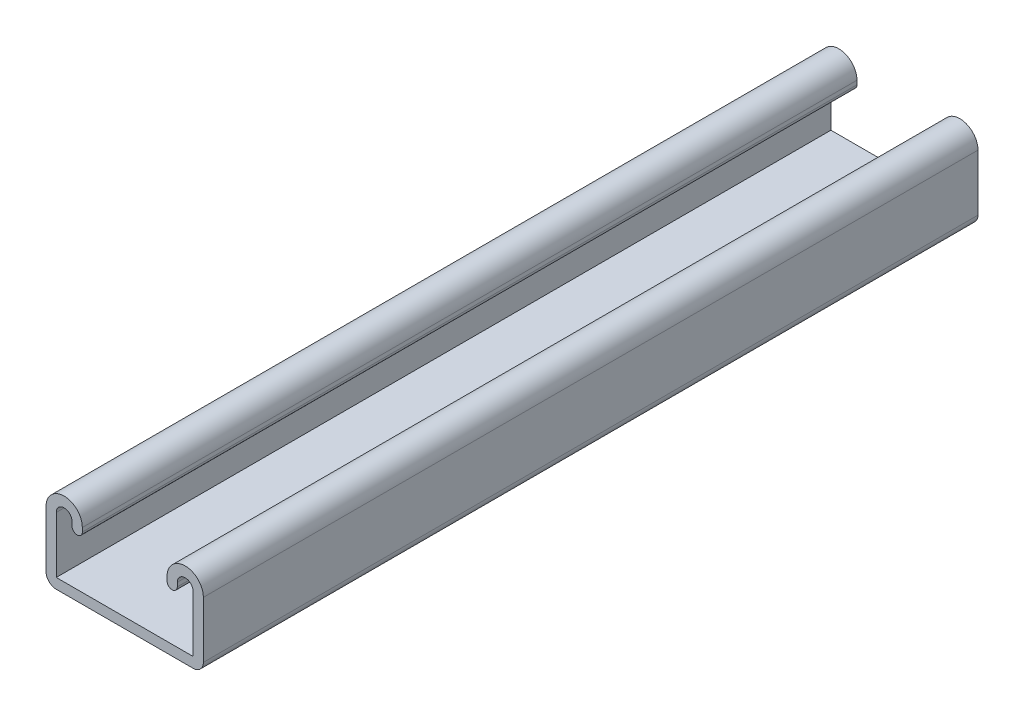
ISO-10303-21;
HEADER;
FILE_DESCRIPTION(('STEP AP214'),'2;1');
FILE_NAME('part.step','',(''),(''),'','','');
FILE_SCHEMA(('AUTOMOTIVE_DESIGN { 1 0 10303 214 1 1 1 1 }'));
ENDSEC;
DATA;
#1=APPLICATION_CONTEXT('core data for automotive mechanical design processes');
#2=APPLICATION_PROTOCOL_DEFINITION('international standard','automotive_design',2000,#1);
#3=PRODUCT_CONTEXT('',#1,'mechanical');
#4=PRODUCT('Part','Part','',(#3));
#5=PRODUCT_RELATED_PRODUCT_CATEGORY('part','',(#4));
#6=PRODUCT_DEFINITION_FORMATION('','',#4);
#7=PRODUCT_DEFINITION_CONTEXT('part definition',#1,'design');
#8=PRODUCT_DEFINITION('design','',#6,#7);
#9=PRODUCT_DEFINITION_SHAPE('','',#8);
#10=(LENGTH_UNIT() NAMED_UNIT(*) SI_UNIT(.MILLI.,.METRE.));
#11=(NAMED_UNIT(*) PLANE_ANGLE_UNIT() SI_UNIT($,.RADIAN.));
#12=(NAMED_UNIT(*) SI_UNIT($,.STERADIAN.) SOLID_ANGLE_UNIT());
#13=UNCERTAINTY_MEASURE_WITH_UNIT(LENGTH_MEASURE(1.E-05),#10,'distance_accuracy_value','');
#14=(GEOMETRIC_REPRESENTATION_CONTEXT(3) GLOBAL_UNCERTAINTY_ASSIGNED_CONTEXT((#13)) GLOBAL_UNIT_ASSIGNED_CONTEXT((#10,
#11,#12)) REPRESENTATION_CONTEXT('',''));
#15=CARTESIAN_POINT('',(0.,0.,0.));
#16=DIRECTION('',(0.,0.,1.));
#17=DIRECTION('',(1.,0.,0.));
#18=AXIS2_PLACEMENT_3D('',#15,#16,#17);
#19=CARTESIAN_POINT('',(-15.875,8.3693,203.2));
#20=DIRECTION('',(0.,0.,-1.));
#21=DIRECTION('',(-1.,0.,0.));
#22=AXIS2_PLACEMENT_3D('',#19,#20,#21);
#23=CYLINDRICAL_SURFACE('',#22,4.7625);
#24=CARTESIAN_POINT('',(-15.875,8.3693,0.));
#25=DIRECTION('',(0.,0.,1.));
#26=DIRECTION('',(-1.,0.,0.));
#27=AXIS2_PLACEMENT_3D('',#24,#25,#26);
#28=CIRCLE('',#27,4.7625);
#29=CARTESIAN_POINT('',(-11.1125,8.3693,0.));
#30=VERTEX_POINT('',#29);
#31=CARTESIAN_POINT('',(-20.6375,8.3693,0.));
#32=VERTEX_POINT('',#31);
#33=EDGE_CURVE('E278',#30,#32,#28,.T.);
#34=ORIENTED_EDGE('',*,*,#33,.T.);
#35=DIRECTION('',(0.,0.,-1.));
#36=VECTOR('',#35,1.);
#37=CARTESIAN_POINT('',(-20.6375,8.3693,203.2));
#38=LINE('',#37,#36);
#39=CARTESIAN_POINT('',(-20.6375,8.3693,203.2));
#40=VERTEX_POINT('',#39);
#41=EDGE_CURVE('E467',#40,#32,#38,.T.);
#42=ORIENTED_EDGE('',*,*,#41,.F.);
#43=CARTESIAN_POINT('',(-15.875,8.3693,203.2));
#44=DIRECTION('',(0.,0.,1.));
#45=DIRECTION('',(-1.,0.,0.));
#46=AXIS2_PLACEMENT_3D('',#43,#44,#45);
#47=CIRCLE('',#46,4.7625);
#48=CARTESIAN_POINT('',(-11.1125,8.3693,203.2));
#49=VERTEX_POINT('',#48);
#50=EDGE_CURVE('E286',#49,#40,#47,.T.);
#51=ORIENTED_EDGE('',*,*,#50,.F.);
#52=DIRECTION('',(0.,0.,-1.));
#53=VECTOR('',#52,1.);
#54=CARTESIAN_POINT('',(-11.1125,8.3693,203.2));
#55=LINE('',#54,#53);
#56=EDGE_CURVE('E344',#49,#30,#55,.T.);
#57=ORIENTED_EDGE('',*,*,#56,.T.);
#58=EDGE_LOOP('',(#34,#42,#51,#57));
#59=FACE_BOUND('',#58,.T.);
#60=ADVANCED_FACE('F41',(#59),#23,.T.);
#61=CARTESIAN_POINT('',(-20.6375,8.3693,203.2));
#62=DIRECTION('',(1.,0.,0.));
#63=DIRECTION('',(0.,1.,0.));
#64=AXIS2_PLACEMENT_3D('',#61,#62,#63);
#65=PLANE('',#64);
#66=DIRECTION('',(0.,-1.,0.));
#67=VECTOR('',#66,1.);
#68=CARTESIAN_POINT('',(-20.6375,8.3693,0.));
#69=LINE('',#68,#67);
#70=CARTESIAN_POINT('',(-20.6375,-6.4008,0.));
#71=VERTEX_POINT('',#70);
#72=EDGE_CURVE('E347',#32,#71,#69,.T.);
#73=ORIENTED_EDGE('',*,*,#72,.T.);
#74=DIRECTION('',(0.,0.,-1.));
#75=VECTOR('',#74,1.);
#76=CARTESIAN_POINT('',(-20.6375,-6.4008,203.2));
#77=LINE('',#76,#75);
#78=CARTESIAN_POINT('',(-20.6375,-6.4008,203.2));
#79=VERTEX_POINT('',#78);
#80=EDGE_CURVE('E464',#79,#71,#77,.T.);
#81=ORIENTED_EDGE('',*,*,#80,.F.);
#82=DIRECTION('',(0.,-1.,0.));
#83=VECTOR('',#82,1.);
#84=CARTESIAN_POINT('',(-20.6375,8.3693,203.2));
#85=LINE('',#84,#83);
#86=EDGE_CURVE('E291',#40,#79,#85,.T.);
#87=ORIENTED_EDGE('',*,*,#86,.F.);
#88=ORIENTED_EDGE('',*,*,#41,.T.);
#89=EDGE_LOOP('',(#73,#81,#87,#88));
#90=FACE_BOUND('',#89,.T.);
#91=ADVANCED_FACE('F514',(#90),#65,.F.);
#92=CARTESIAN_POINT('',(-17.9451,-6.4008,203.2));
#93=DIRECTION('',(0.,0.,-1.));
#94=DIRECTION('',(-1.,0.,0.));
#95=AXIS2_PLACEMENT_3D('',#92,#93,#94);
#96=CYLINDRICAL_SURFACE('',#95,2.6924);
#97=CARTESIAN_POINT('',(-17.9451,-6.4008,0.));
#98=DIRECTION('',(0.,0.,1.));
#99=DIRECTION('',(-1.,0.,0.));
#100=AXIS2_PLACEMENT_3D('',#97,#98,#99);
#101=CIRCLE('',#100,2.6924);
#102=CARTESIAN_POINT('',(-17.9451,-9.0932,0.));
#103=VERTEX_POINT('',#102);
#104=EDGE_CURVE('E354',#71,#103,#101,.T.);
#105=ORIENTED_EDGE('',*,*,#104,.T.);
#106=DIRECTION('',(0.,0.,-1.));
#107=VECTOR('',#106,1.);
#108=CARTESIAN_POINT('',(-17.9451,-9.0932,203.2));
#109=LINE('',#108,#107);
#110=CARTESIAN_POINT('',(-17.9451,-9.0932,203.2));
#111=VERTEX_POINT('',#110);
#112=EDGE_CURVE('E456',#111,#103,#109,.T.);
#113=ORIENTED_EDGE('',*,*,#112,.F.);
#114=CARTESIAN_POINT('',(-17.9451,-6.4008,203.2));
#115=DIRECTION('',(0.,0.,1.));
#116=DIRECTION('',(-1.,0.,0.));
#117=AXIS2_PLACEMENT_3D('',#114,#115,#116);
#118=CIRCLE('',#117,2.6924);
#119=EDGE_CURVE('E300',#79,#111,#118,.T.);
#120=ORIENTED_EDGE('',*,*,#119,.F.);
#121=ORIENTED_EDGE('',*,*,#80,.T.);
#122=EDGE_LOOP('',(#105,#113,#120,#121));
#123=FACE_BOUND('',#122,.T.);
#124=ADVANCED_FACE('F517',(#123),#96,.T.);
#125=CARTESIAN_POINT('',(-17.9451,-9.0932,203.2));
#126=DIRECTION('',(0.,1.,0.));
#127=DIRECTION('',(0.,0.,1.));
#128=AXIS2_PLACEMENT_3D('',#125,#126,#127);
#129=PLANE('',#128);
#130=DIRECTION('',(0.,0.,-1.));
#131=VECTOR('',#130,1.);
#132=CARTESIAN_POINT('',(-5.159375,-9.09319999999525,114.3));
#133=LINE('',#132,#131);
#134=CARTESIAN_POINT('',(-5.15937500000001,-9.0932,180.18125));
#135=VERTEX_POINT('',#134);
#136=CARTESIAN_POINT('',(-5.159375,-9.09319999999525,114.3));
#137=VERTEX_POINT('',#136);
#138=EDGE_CURVE('E218',#135,#137,#133,.T.);
#139=ORIENTED_EDGE('',*,*,#138,.F.);
#140=CARTESIAN_POINT('',(0.,-9.09319999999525,180.18125));
#141=DIRECTION('',(0.,-1.,0.));
#142=DIRECTION('',(0.,0.,-1.));
#143=AXIS2_PLACEMENT_3D('',#140,#141,#142);
#144=CIRCLE('',#143,5.159375);
#145=CARTESIAN_POINT('',(5.159375,-9.09319999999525,180.18125));
#146=VERTEX_POINT('',#145);
#147=EDGE_CURVE('E57',#146,#135,#144,.T.);
#148=ORIENTED_EDGE('',*,*,#147,.F.);
#149=DIRECTION('',(0.,0.,1.));
#150=VECTOR('',#149,1.);
#151=CARTESIAN_POINT('',(5.159375,-9.09319999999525,180.18125));
#152=LINE('',#151,#150);
#153=CARTESIAN_POINT('',(5.159375,-9.09319999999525,114.3));
#154=VERTEX_POINT('',#153);
#155=EDGE_CURVE('E234',#154,#146,#152,.T.);
#156=ORIENTED_EDGE('',*,*,#155,.F.);
#157=CARTESIAN_POINT('',(0.,-9.09319999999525,114.3));
#158=DIRECTION('',(0.,-1.,0.));
#159=DIRECTION('',(0.,0.,-1.));
#160=AXIS2_PLACEMENT_3D('',#157,#158,#159);
#161=CIRCLE('',#160,5.159375);
#162=EDGE_CURVE('E227',#137,#154,#161,.T.);
#163=ORIENTED_EDGE('',*,*,#162,.F.);
#164=EDGE_LOOP('',(#139,#148,#156,#163));
#165=FACE_BOUND('',#164,.T.);
#166=DIRECTION('',(0.,0.,-1.));
#167=VECTOR('',#166,1.);
#168=CARTESIAN_POINT('',(-5.159375,-9.09319999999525,12.7));
#169=LINE('',#168,#167);
#170=CARTESIAN_POINT('',(-5.15937500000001,-9.0932,78.58125));
#171=VERTEX_POINT('',#170);
#172=CARTESIAN_POINT('',(-5.159375,-9.09319999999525,12.7));
#173=VERTEX_POINT('',#172);
#174=EDGE_CURVE('E261',#171,#173,#169,.T.);
#175=ORIENTED_EDGE('',*,*,#174,.F.);
#176=CARTESIAN_POINT('',(0.,-9.09319999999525,78.58125));
#177=DIRECTION('',(0.,-1.,0.));
#178=DIRECTION('',(0.,0.,-1.));
#179=AXIS2_PLACEMENT_3D('',#176,#177,#178);
#180=CIRCLE('',#179,5.159375);
#181=CARTESIAN_POINT('',(5.159375,-9.09319999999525,78.58125));
#182=VERTEX_POINT('',#181);
#183=EDGE_CURVE('E259',#182,#171,#180,.T.);
#184=ORIENTED_EDGE('',*,*,#183,.F.);
#185=DIRECTION('',(0.,0.,1.));
#186=VECTOR('',#185,1.);
#187=CARTESIAN_POINT('',(5.159375,-9.09319999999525,78.58125));
#188=LINE('',#187,#186);
#189=CARTESIAN_POINT('',(5.159375,-9.09319999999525,12.7));
#190=VERTEX_POINT('',#189);
#191=EDGE_CURVE('E272',#190,#182,#188,.T.);
#192=ORIENTED_EDGE('',*,*,#191,.F.);
#193=CARTESIAN_POINT('',(0.,-9.09319999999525,12.7));
#194=DIRECTION('',(0.,-1.,0.));
#195=DIRECTION('',(0.,0.,-1.));
#196=AXIS2_PLACEMENT_3D('',#193,#194,#195);
#197=CIRCLE('',#196,5.159375);
#198=EDGE_CURVE('E269',#173,#190,#197,.T.);
#199=ORIENTED_EDGE('',*,*,#198,.F.);
#200=EDGE_LOOP('',(#175,#184,#192,#199));
#201=FACE_BOUND('',#200,.T.);
#202=DIRECTION('',(1.,0.,0.));
#203=VECTOR('',#202,1.);
#204=CARTESIAN_POINT('',(-17.9451,-9.0932,0.));
#205=LINE('',#204,#203);
#206=CARTESIAN_POINT('',(17.9451,-9.0932,0.));
#207=VERTEX_POINT('',#206);
#208=EDGE_CURVE('E353',#103,#207,#205,.T.);
#209=ORIENTED_EDGE('',*,*,#208,.T.);
#210=DIRECTION('',(0.,0.,-1.));
#211=VECTOR('',#210,1.);
#212=CARTESIAN_POINT('',(17.9451,-9.0932,203.2));
#213=LINE('',#212,#211);
#214=CARTESIAN_POINT('',(17.9451,-9.0932,203.2));
#215=VERTEX_POINT('',#214);
#216=EDGE_CURVE('E453',#215,#207,#213,.T.);
#217=ORIENTED_EDGE('',*,*,#216,.F.);
#218=DIRECTION('',(1.,0.,0.));
#219=VECTOR('',#218,1.);
#220=CARTESIAN_POINT('',(-17.9451,-9.0932,203.2));
#221=LINE('',#220,#219);
#222=EDGE_CURVE('E297',#111,#215,#221,.T.);
#223=ORIENTED_EDGE('',*,*,#222,.F.);
#224=ORIENTED_EDGE('',*,*,#112,.T.);
#225=EDGE_LOOP('',(#209,#217,#223,#224));
#226=FACE_BOUND('',#225,.T.);
#227=ADVANCED_FACE('F235',(#165,#201,#226),#129,.F.);
#228=CARTESIAN_POINT('',(17.9451,-6.4008,203.2));
#229=DIRECTION('',(0.,0.,-1.));
#230=DIRECTION('',(-1.,0.,0.));
#231=AXIS2_PLACEMENT_3D('',#228,#229,#230);
#232=CYLINDRICAL_SURFACE('',#231,2.6924);
#233=CARTESIAN_POINT('',(17.9451,-6.4008,0.));
#234=DIRECTION('',(0.,0.,1.));
#235=DIRECTION('',(1.,0.,0.));
#236=AXIS2_PLACEMENT_3D('',#233,#234,#235);
#237=CIRCLE('',#236,2.6924);
#238=CARTESIAN_POINT('',(20.6375,-6.4008,0.));
#239=VERTEX_POINT('',#238);
#240=EDGE_CURVE('E356',#207,#239,#237,.T.);
#241=ORIENTED_EDGE('',*,*,#240,.T.);
#242=DIRECTION('',(0.,0.,-1.));
#243=VECTOR('',#242,1.);
#244=CARTESIAN_POINT('',(20.6375,-6.4008,203.2));
#245=LINE('',#244,#243);
#246=CARTESIAN_POINT('',(20.6375,-6.4008,203.2));
#247=VERTEX_POINT('',#246);
#248=EDGE_CURVE('E448',#247,#239,#245,.T.);
#249=ORIENTED_EDGE('',*,*,#248,.F.);
#250=CARTESIAN_POINT('',(17.9451,-6.4008,203.2));
#251=DIRECTION('',(0.,0.,1.));
#252=DIRECTION('',(1.,0.,0.));
#253=AXIS2_PLACEMENT_3D('',#250,#251,#252);
#254=CIRCLE('',#253,2.6924);
#255=EDGE_CURVE('E303',#215,#247,#254,.T.);
#256=ORIENTED_EDGE('',*,*,#255,.F.);
#257=ORIENTED_EDGE('',*,*,#216,.T.);
#258=EDGE_LOOP('',(#241,#249,#256,#257));
#259=FACE_BOUND('',#258,.T.);
#260=ADVANCED_FACE('F596',(#259),#232,.T.);
#261=CARTESIAN_POINT('',(20.6375,-6.4008,203.2));
#262=DIRECTION('',(-1.,0.,0.));
#263=DIRECTION('',(0.,-1.,0.));
#264=AXIS2_PLACEMENT_3D('',#261,#262,#263);
#265=PLANE('',#264);
#266=DIRECTION('',(0.,1.,0.));
#267=VECTOR('',#266,1.);
#268=CARTESIAN_POINT('',(20.6375,-6.4008,0.));
#269=LINE('',#268,#267);
#270=CARTESIAN_POINT('',(20.6375,8.3693,0.));
#271=VERTEX_POINT('',#270);
#272=EDGE_CURVE('E363',#239,#271,#269,.T.);
#273=ORIENTED_EDGE('',*,*,#272,.T.);
#274=DIRECTION('',(0.,0.,-1.));
#275=VECTOR('',#274,1.);
#276=CARTESIAN_POINT('',(20.6375,8.3693,203.2));
#277=LINE('',#276,#275);
#278=CARTESIAN_POINT('',(20.6375,8.3693,203.2));
#279=VERTEX_POINT('',#278);
#280=EDGE_CURVE('E447',#279,#271,#277,.T.);
#281=ORIENTED_EDGE('',*,*,#280,.F.);
#282=DIRECTION('',(0.,1.,0.));
#283=VECTOR('',#282,1.);
#284=CARTESIAN_POINT('',(20.6375,-6.4008,203.2));
#285=LINE('',#284,#283);
#286=EDGE_CURVE('E306',#247,#279,#285,.T.);
#287=ORIENTED_EDGE('',*,*,#286,.F.);
#288=ORIENTED_EDGE('',*,*,#248,.T.);
#289=EDGE_LOOP('',(#273,#281,#287,#288));
#290=FACE_BOUND('',#289,.T.);
#291=ADVANCED_FACE('F591',(#290),#265,.F.);
#292=CARTESIAN_POINT('',(15.875,8.3693,203.2));
#293=DIRECTION('',(0.,0.,-1.));
#294=DIRECTION('',(-1.,0.,0.));
#295=AXIS2_PLACEMENT_3D('',#292,#293,#294);
#296=CYLINDRICAL_SURFACE('',#295,4.7625);
#297=CARTESIAN_POINT('',(15.875,8.3693,0.));
#298=DIRECTION('',(0.,0.,1.));
#299=DIRECTION('',(1.,0.,0.));
#300=AXIS2_PLACEMENT_3D('',#297,#298,#299);
#301=CIRCLE('',#300,4.7625);
#302=CARTESIAN_POINT('',(11.1125,8.3693,0.));
#303=VERTEX_POINT('',#302);
#304=EDGE_CURVE('E364',#271,#303,#301,.T.);
#305=ORIENTED_EDGE('',*,*,#304,.T.);
#306=DIRECTION('',(0.,0.,-1.));
#307=VECTOR('',#306,1.);
#308=CARTESIAN_POINT('',(11.1125,8.3693,203.2));
#309=LINE('',#308,#307);
#310=CARTESIAN_POINT('',(11.1125,8.3693,203.2));
#311=VERTEX_POINT('',#310);
#312=EDGE_CURVE('E445',#311,#303,#309,.T.);
#313=ORIENTED_EDGE('',*,*,#312,.F.);
#314=CARTESIAN_POINT('',(15.875,8.3693,203.2));
#315=DIRECTION('',(0.,0.,1.));
#316=DIRECTION('',(1.,0.,0.));
#317=AXIS2_PLACEMENT_3D('',#314,#315,#316);
#318=CIRCLE('',#317,4.7625);
#319=EDGE_CURVE('E307',#279,#311,#318,.T.);
#320=ORIENTED_EDGE('',*,*,#319,.F.);
#321=ORIENTED_EDGE('',*,*,#280,.T.);
#322=EDGE_LOOP('',(#305,#313,#320,#321));
#323=FACE_BOUND('',#322,.T.);
#324=ADVANCED_FACE('F587',(#323),#296,.T.);
#325=CARTESIAN_POINT('',(11.1125,8.3693,203.2));
#326=DIRECTION('',(1.,0.,0.));
#327=DIRECTION('',(0.,0.,-1.));
#328=AXIS2_PLACEMENT_3D('',#325,#326,#327);
#329=PLANE('',#328);
#330=DIRECTION('',(0.,-1.,0.));
#331=VECTOR('',#330,1.);
#332=CARTESIAN_POINT('',(11.1125,8.3693,0.));
#333=LINE('',#332,#331);
#334=CARTESIAN_POINT('',(11.1125,7.33425,0.));
#335=VERTEX_POINT('',#334);
#336=EDGE_CURVE('E370',#303,#335,#333,.T.);
#337=ORIENTED_EDGE('',*,*,#336,.T.);
#338=DIRECTION('',(0.,0.,-1.));
#339=VECTOR('',#338,1.);
#340=CARTESIAN_POINT('',(11.1125,7.33425,203.2));
#341=LINE('',#340,#339);
#342=CARTESIAN_POINT('',(11.1125,7.33425,203.2));
#343=VERTEX_POINT('',#342);
#344=EDGE_CURVE('E438',#343,#335,#341,.T.);
#345=ORIENTED_EDGE('',*,*,#344,.F.);
#346=DIRECTION('',(0.,-1.,0.));
#347=VECTOR('',#346,1.);
#348=CARTESIAN_POINT('',(11.1125,8.3693,203.2));
#349=LINE('',#348,#347);
#350=EDGE_CURVE('E315',#311,#343,#349,.T.);
#351=ORIENTED_EDGE('',*,*,#350,.F.);
#352=ORIENTED_EDGE('',*,*,#312,.T.);
#353=EDGE_LOOP('',(#337,#345,#351,#352));
#354=FACE_BOUND('',#353,.T.);
#355=ADVANCED_FACE('F582',(#354),#329,.F.);
#356=CARTESIAN_POINT('',(12.4587,7.33425,203.2));
#357=DIRECTION('',(0.,0.,-1.));
#358=DIRECTION('',(-1.,0.,0.));
#359=AXIS2_PLACEMENT_3D('',#356,#357,#358);
#360=CYLINDRICAL_SURFACE('',#359,1.3462);
#361=CARTESIAN_POINT('',(12.4587,7.33425,0.));
#362=DIRECTION('',(0.,0.,1.));
#363=DIRECTION('',(1.,0.,0.));
#364=AXIS2_PLACEMENT_3D('',#361,#362,#363);
#365=CIRCLE('',#364,1.3462);
#366=CARTESIAN_POINT('',(13.8049,7.33425,0.));
#367=VERTEX_POINT('',#366);
#368=EDGE_CURVE('E369',#335,#367,#365,.T.);
#369=ORIENTED_EDGE('',*,*,#368,.T.);
#370=DIRECTION('',(0.,0.,-1.));
#371=VECTOR('',#370,1.);
#372=CARTESIAN_POINT('',(13.8049,7.33425,203.2));
#373=LINE('',#372,#371);
#374=CARTESIAN_POINT('',(13.8049,7.33425,203.2));
#375=VERTEX_POINT('',#374);
#376=EDGE_CURVE('E432',#375,#367,#373,.T.);
#377=ORIENTED_EDGE('',*,*,#376,.F.);
#378=CARTESIAN_POINT('',(12.4587,7.33425,203.2));
#379=DIRECTION('',(0.,0.,1.));
#380=DIRECTION('',(1.,0.,0.));
#381=AXIS2_PLACEMENT_3D('',#378,#379,#380);
#382=CIRCLE('',#381,1.3462);
#383=EDGE_CURVE('E314',#343,#375,#382,.T.);
#384=ORIENTED_EDGE('',*,*,#383,.F.);
#385=ORIENTED_EDGE('',*,*,#344,.T.);
#386=EDGE_LOOP('',(#369,#377,#384,#385));
#387=FACE_BOUND('',#386,.T.);
#388=ADVANCED_FACE('F576',(#387),#360,.T.);
#389=CARTESIAN_POINT('',(13.8049,8.3693,203.2));
#390=DIRECTION('',(-1.,0.,0.));
#391=DIRECTION('',(0.,0.,1.));
#392=AXIS2_PLACEMENT_3D('',#389,#390,#391);
#393=PLANE('',#392);
#394=DIRECTION('',(0.,1.,0.));
#395=VECTOR('',#394,1.);
#396=CARTESIAN_POINT('',(13.8049,8.3693,0.));
#397=LINE('',#396,#395);
#398=CARTESIAN_POINT('',(13.8049,8.3693,0.));
#399=VERTEX_POINT('',#398);
#400=EDGE_CURVE('E373',#367,#399,#397,.T.);
#401=ORIENTED_EDGE('',*,*,#400,.T.);
#402=DIRECTION('',(0.,0.,-1.));
#403=VECTOR('',#402,1.);
#404=CARTESIAN_POINT('',(13.8049,8.3693,203.2));
#405=LINE('',#404,#403);
#406=CARTESIAN_POINT('',(13.8049,8.3693,203.2));
#407=VERTEX_POINT('',#406);
#408=EDGE_CURVE('E427',#407,#399,#405,.T.);
#409=ORIENTED_EDGE('',*,*,#408,.F.);
#410=DIRECTION('',(0.,1.,0.));
#411=VECTOR('',#410,1.);
#412=CARTESIAN_POINT('',(13.8049,8.3693,203.2));
#413=LINE('',#412,#411);
#414=EDGE_CURVE('E319',#375,#407,#413,.T.);
#415=ORIENTED_EDGE('',*,*,#414,.F.);
#416=ORIENTED_EDGE('',*,*,#376,.T.);
#417=EDGE_LOOP('',(#401,#409,#415,#416));
#418=FACE_BOUND('',#417,.T.);
#419=ADVANCED_FACE('F573',(#418),#393,.F.);
#420=CARTESIAN_POINT('',(15.875,8.3693,203.2));
#421=DIRECTION('',(0.,0.,-1.));
#422=DIRECTION('',(-1.,0.,0.));
#423=AXIS2_PLACEMENT_3D('',#420,#421,#422);
#424=CYLINDRICAL_SURFACE('',#423,2.0701);
#425=CARTESIAN_POINT('',(15.875,8.3693,0.));
#426=DIRECTION('',(0.,0.,-1.));
#427=DIRECTION('',(1.,0.,0.));
#428=AXIS2_PLACEMENT_3D('',#425,#426,#427);
#429=CIRCLE('',#428,2.0701);
#430=CARTESIAN_POINT('',(17.9451,8.3693,0.));
#431=VERTEX_POINT('',#430);
#432=EDGE_CURVE('E376',#399,#431,#429,.T.);
#433=ORIENTED_EDGE('',*,*,#432,.T.);
#434=DIRECTION('',(0.,0.,-1.));
#435=VECTOR('',#434,1.);
#436=CARTESIAN_POINT('',(17.9451,8.3693,203.2));
#437=LINE('',#436,#435);
#438=CARTESIAN_POINT('',(17.9451,8.3693,203.2));
#439=VERTEX_POINT('',#438);
#440=EDGE_CURVE('E428',#439,#431,#437,.T.);
#441=ORIENTED_EDGE('',*,*,#440,.F.);
#442=CARTESIAN_POINT('',(15.875,8.3693,203.2));
#443=DIRECTION('',(0.,0.,-1.));
#444=DIRECTION('',(1.,0.,0.));
#445=AXIS2_PLACEMENT_3D('',#442,#443,#444);
#446=CIRCLE('',#445,2.0701);
#447=EDGE_CURVE('E321',#407,#439,#446,.T.);
#448=ORIENTED_EDGE('',*,*,#447,.F.);
#449=ORIENTED_EDGE('',*,*,#408,.T.);
#450=EDGE_LOOP('',(#433,#441,#448,#449));
#451=FACE_BOUND('',#450,.T.);
#452=ADVANCED_FACE('F568',(#451),#424,.F.);
#453=CARTESIAN_POINT('',(17.9451,-6.4008,203.2));
#454=DIRECTION('',(1.,0.,0.));
#455=DIRECTION('',(0.,1.,0.));
#456=AXIS2_PLACEMENT_3D('',#453,#454,#455);
#457=PLANE('',#456);
#458=DIRECTION('',(0.,-1.,0.));
#459=VECTOR('',#458,1.);
#460=CARTESIAN_POINT('',(17.9451,-6.4008,0.));
#461=LINE('',#460,#459);
#462=CARTESIAN_POINT('',(17.9451,-6.4008,0.));
#463=VERTEX_POINT('',#462);
#464=EDGE_CURVE('E378',#431,#463,#461,.T.);
#465=ORIENTED_EDGE('',*,*,#464,.T.);
#466=DIRECTION('',(0.,0.,-1.));
#467=VECTOR('',#466,1.);
#468=CARTESIAN_POINT('',(17.9451,-6.4008,203.2));
#469=LINE('',#468,#467);
#470=CARTESIAN_POINT('',(17.9451,-6.4008,203.2));
#471=VERTEX_POINT('',#470);
#472=EDGE_CURVE('E422',#471,#463,#469,.T.);
#473=ORIENTED_EDGE('',*,*,#472,.F.);
#474=DIRECTION('',(0.,-1.,0.));
#475=VECTOR('',#474,1.);
#476=CARTESIAN_POINT('',(17.9451,-6.4008,203.2));
#477=LINE('',#476,#475);
#478=EDGE_CURVE('E323',#439,#471,#477,.T.);
#479=ORIENTED_EDGE('',*,*,#478,.F.);
#480=ORIENTED_EDGE('',*,*,#440,.T.);
#481=EDGE_LOOP('',(#465,#473,#479,#480));
#482=FACE_BOUND('',#481,.T.);
#483=ADVANCED_FACE('F562',(#482),#457,.F.);
#484=CARTESIAN_POINT('',(-17.9451,-6.4008,203.2));
#485=DIRECTION('',(0.,-1.,0.));
#486=DIRECTION('',(0.,0.,-1.));
#487=AXIS2_PLACEMENT_3D('',#484,#485,#486);
#488=PLANE('',#487);
#489=DIRECTION('',(0.,0.,1.));
#490=VECTOR('',#489,1.);
#491=CARTESIAN_POINT('',(5.159375,-6.4008,304.8));
#492=LINE('',#491,#490);
#493=CARTESIAN_POINT('',(5.159375,-6.4008,114.3));
#494=VERTEX_POINT('',#493);
#495=CARTESIAN_POINT('',(5.159375,-6.4008,180.18125));
#496=VERTEX_POINT('',#495);
#497=EDGE_CURVE('E249',#494,#496,#492,.T.);
#498=ORIENTED_EDGE('',*,*,#497,.T.);
#499=CARTESIAN_POINT('',(0.,-6.4008,180.18125));
#500=DIRECTION('',(0.,-1.,0.));
#501=DIRECTION('',(0.,0.,-1.));
#502=AXIS2_PLACEMENT_3D('',#499,#500,#501);
#503=CIRCLE('',#502,5.159375);
#504=CARTESIAN_POINT('',(-5.15937500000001,-6.4008,180.18125));
#505=VERTEX_POINT('',#504);
#506=EDGE_CURVE('E256',#496,#505,#503,.T.);
#507=ORIENTED_EDGE('',*,*,#506,.T.);
#508=DIRECTION('',(0.,0.,-1.));
#509=VECTOR('',#508,1.);
#510=CARTESIAN_POINT('',(-5.15937500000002,-6.4008,304.8));
#511=LINE('',#510,#509);
#512=CARTESIAN_POINT('',(-5.159375,-6.4008,114.3));
#513=VERTEX_POINT('',#512);
#514=EDGE_CURVE('E221',#505,#513,#511,.T.);
#515=ORIENTED_EDGE('',*,*,#514,.T.);
#516=CARTESIAN_POINT('',(0.,-6.4008,114.3));
#517=DIRECTION('',(0.,-1.,0.));
#518=DIRECTION('',(0.,0.,-1.));
#519=AXIS2_PLACEMENT_3D('',#516,#517,#518);
#520=CIRCLE('',#519,5.159375);
#521=EDGE_CURVE('E63',#513,#494,#520,.T.);
#522=ORIENTED_EDGE('',*,*,#521,.T.);
#523=EDGE_LOOP('',(#498,#507,#515,#522));
#524=FACE_BOUND('',#523,.T.);
#525=DIRECTION('',(0.,0.,1.));
#526=VECTOR('',#525,1.);
#527=CARTESIAN_POINT('',(5.159375,-6.4008,203.2));
#528=LINE('',#527,#526);
#529=CARTESIAN_POINT('',(5.159375,-6.4008,12.7));
#530=VERTEX_POINT('',#529);
#531=CARTESIAN_POINT('',(5.159375,-6.4008,78.58125));
#532=VERTEX_POINT('',#531);
#533=EDGE_CURVE('E47',#530,#532,#528,.T.);
#534=ORIENTED_EDGE('',*,*,#533,.T.);
#535=CARTESIAN_POINT('',(0.,-6.4008,78.58125));
#536=DIRECTION('',(0.,-1.,0.));
#537=DIRECTION('',(0.,0.,-1.));
#538=AXIS2_PLACEMENT_3D('',#535,#536,#537);
#539=CIRCLE('',#538,5.159375);
#540=CARTESIAN_POINT('',(-5.15937500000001,-6.4008,78.58125));
#541=VERTEX_POINT('',#540);
#542=EDGE_CURVE('E11',#532,#541,#539,.T.);
#543=ORIENTED_EDGE('',*,*,#542,.T.);
#544=DIRECTION('',(0.,0.,-1.));
#545=VECTOR('',#544,1.);
#546=CARTESIAN_POINT('',(-5.15937500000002,-6.4008,203.2));
#547=LINE('',#546,#545);
#548=CARTESIAN_POINT('',(-5.159375,-6.4008,12.7));
#549=VERTEX_POINT('',#548);
#550=EDGE_CURVE('E468',#541,#549,#547,.T.);
#551=ORIENTED_EDGE('',*,*,#550,.T.);
#552=CARTESIAN_POINT('',(0.,-6.4008,12.7));
#553=DIRECTION('',(0.,-1.,0.));
#554=DIRECTION('',(0.,0.,-1.));
#555=AXIS2_PLACEMENT_3D('',#552,#553,#554);
#556=CIRCLE('',#555,5.159375);
#557=EDGE_CURVE('E473',#549,#530,#556,.T.);
#558=ORIENTED_EDGE('',*,*,#557,.T.);
#559=EDGE_LOOP('',(#534,#543,#551,#558));
#560=FACE_BOUND('',#559,.T.);
#561=DIRECTION('',(-1.,0.,0.));
#562=VECTOR('',#561,1.);
#563=CARTESIAN_POINT('',(-17.9451,-6.4008,0.));
#564=LINE('',#563,#562);
#565=CARTESIAN_POINT('',(-17.9451,-6.4008,0.));
#566=VERTEX_POINT('',#565);
#567=EDGE_CURVE('E385',#463,#566,#564,.T.);
#568=ORIENTED_EDGE('',*,*,#567,.T.);
#569=DIRECTION('',(0.,0.,-1.));
#570=VECTOR('',#569,1.);
#571=CARTESIAN_POINT('',(-17.9451,-6.4008,203.2));
#572=LINE('',#571,#570);
#573=CARTESIAN_POINT('',(-17.9451,-6.4008,203.2));
#574=VERTEX_POINT('',#573);
#575=EDGE_CURVE('E420',#574,#566,#572,.T.);
#576=ORIENTED_EDGE('',*,*,#575,.F.);
#577=DIRECTION('',(-1.,0.,0.));
#578=VECTOR('',#577,1.);
#579=CARTESIAN_POINT('',(-17.9451,-6.4008,203.2));
#580=LINE('',#579,#578);
#581=EDGE_CURVE('E330',#471,#574,#580,.T.);
#582=ORIENTED_EDGE('',*,*,#581,.F.);
#583=ORIENTED_EDGE('',*,*,#472,.T.);
#584=EDGE_LOOP('',(#568,#576,#582,#583));
#585=FACE_BOUND('',#584,.T.);
#586=ADVANCED_FACE('F482',(#524,#560,#585),#488,.F.);
#587=CARTESIAN_POINT('',(-17.9451,8.3693,203.2));
#588=DIRECTION('',(-1.,0.,0.));
#589=DIRECTION('',(0.,-1.,0.));
#590=AXIS2_PLACEMENT_3D('',#587,#588,#589);
#591=PLANE('',#590);
#592=DIRECTION('',(0.,1.,0.));
#593=VECTOR('',#592,1.);
#594=CARTESIAN_POINT('',(-17.9451,8.3693,0.));
#595=LINE('',#594,#593);
#596=CARTESIAN_POINT('',(-17.9451,8.3693,0.));
#597=VERTEX_POINT('',#596);
#598=EDGE_CURVE('E383',#566,#597,#595,.T.);
#599=ORIENTED_EDGE('',*,*,#598,.T.);
#600=DIRECTION('',(0.,0.,-1.));
#601=VECTOR('',#600,1.);
#602=CARTESIAN_POINT('',(-17.9451,8.3693,203.2));
#603=LINE('',#602,#601);
#604=CARTESIAN_POINT('',(-17.9451,8.3693,203.2));
#605=VERTEX_POINT('',#604);
#606=EDGE_CURVE('E412',#605,#597,#603,.T.);
#607=ORIENTED_EDGE('',*,*,#606,.F.);
#608=DIRECTION('',(0.,1.,0.));
#609=VECTOR('',#608,1.);
#610=CARTESIAN_POINT('',(-17.9451,8.3693,203.2));
#611=LINE('',#610,#609);
#612=EDGE_CURVE('E329',#574,#605,#611,.T.);
#613=ORIENTED_EDGE('',*,*,#612,.F.);
#614=ORIENTED_EDGE('',*,*,#575,.T.);
#615=EDGE_LOOP('',(#599,#607,#613,#614));
#616=FACE_BOUND('',#615,.T.);
#617=ADVANCED_FACE('F554',(#616),#591,.F.);
#618=CARTESIAN_POINT('',(-15.875,8.3693,203.2));
#619=DIRECTION('',(0.,0.,-1.));
#620=DIRECTION('',(-1.,0.,0.));
#621=AXIS2_PLACEMENT_3D('',#618,#619,#620);
#622=CYLINDRICAL_SURFACE('',#621,2.0701);
#623=CARTESIAN_POINT('',(-15.875,8.3693,0.));
#624=DIRECTION('',(0.,0.,-1.));
#625=DIRECTION('',(-1.,0.,0.));
#626=AXIS2_PLACEMENT_3D('',#623,#624,#625);
#627=CIRCLE('',#626,2.0701);
#628=CARTESIAN_POINT('',(-13.8049,8.3693,0.));
#629=VERTEX_POINT('',#628);
#630=EDGE_CURVE('E387',#597,#629,#627,.T.);
#631=ORIENTED_EDGE('',*,*,#630,.T.);
#632=DIRECTION('',(0.,0.,-1.));
#633=VECTOR('',#632,1.);
#634=CARTESIAN_POINT('',(-13.8049,8.3693,203.2));
#635=LINE('',#634,#633);
#636=CARTESIAN_POINT('',(-13.8049,8.3693,203.2));
#637=VERTEX_POINT('',#636);
#638=EDGE_CURVE('E409',#637,#629,#635,.T.);
#639=ORIENTED_EDGE('',*,*,#638,.F.);
#640=CARTESIAN_POINT('',(-15.875,8.3693,203.2));
#641=DIRECTION('',(0.,0.,-1.));
#642=DIRECTION('',(-1.,0.,0.));
#643=AXIS2_PLACEMENT_3D('',#640,#641,#642);
#644=CIRCLE('',#643,2.0701);
#645=EDGE_CURVE('E335',#605,#637,#644,.T.);
#646=ORIENTED_EDGE('',*,*,#645,.F.);
#647=ORIENTED_EDGE('',*,*,#606,.T.);
#648=EDGE_LOOP('',(#631,#639,#646,#647));
#649=FACE_BOUND('',#648,.T.);
#650=ADVANCED_FACE('F553',(#649),#622,.F.);
#651=CARTESIAN_POINT('',(-13.8049,8.3693,203.2));
#652=DIRECTION('',(1.,0.,0.));
#653=DIRECTION('',(0.,1.,0.));
#654=AXIS2_PLACEMENT_3D('',#651,#652,#653);
#655=PLANE('',#654);
#656=DIRECTION('',(0.,-1.,0.));
#657=VECTOR('',#656,1.);
#658=CARTESIAN_POINT('',(-13.8049,8.3693,0.));
#659=LINE('',#658,#657);
#660=CARTESIAN_POINT('',(-13.8049,7.33425,0.));
#661=VERTEX_POINT('',#660);
#662=EDGE_CURVE('E393',#629,#661,#659,.T.);
#663=ORIENTED_EDGE('',*,*,#662,.T.);
#664=DIRECTION('',(0.,0.,-1.));
#665=VECTOR('',#664,1.);
#666=CARTESIAN_POINT('',(-13.8049,7.33425,203.2));
#667=LINE('',#666,#665);
#668=CARTESIAN_POINT('',(-13.8049,7.33425,203.2));
#669=VERTEX_POINT('',#668);
#670=EDGE_CURVE('E406',#669,#661,#667,.T.);
#671=ORIENTED_EDGE('',*,*,#670,.F.);
#672=DIRECTION('',(0.,-1.,0.));
#673=VECTOR('',#672,1.);
#674=CARTESIAN_POINT('',(-13.8049,8.3693,203.2));
#675=LINE('',#674,#673);
#676=EDGE_CURVE('E337',#637,#669,#675,.T.);
#677=ORIENTED_EDGE('',*,*,#676,.F.);
#678=ORIENTED_EDGE('',*,*,#638,.T.);
#679=EDGE_LOOP('',(#663,#671,#677,#678));
#680=FACE_BOUND('',#679,.T.);
#681=ADVANCED_FACE('F547',(#680),#655,.F.);
#682=CARTESIAN_POINT('',(-12.4587,7.33425,203.2));
#683=DIRECTION('',(0.,0.,-1.));
#684=DIRECTION('',(-1.,0.,0.));
#685=AXIS2_PLACEMENT_3D('',#682,#683,#684);
#686=CYLINDRICAL_SURFACE('',#685,1.3462);
#687=CARTESIAN_POINT('',(-12.4587,7.33425,0.));
#688=DIRECTION('',(0.,0.,1.));
#689=DIRECTION('',(-1.,0.,0.));
#690=AXIS2_PLACEMENT_3D('',#687,#688,#689);
#691=CIRCLE('',#690,1.3462);
#692=CARTESIAN_POINT('',(-11.1125,7.33425,0.));
#693=VERTEX_POINT('',#692);
#694=EDGE_CURVE('E392',#661,#693,#691,.T.);
#695=ORIENTED_EDGE('',*,*,#694,.T.);
#696=DIRECTION('',(0.,0.,-1.));
#697=VECTOR('',#696,1.);
#698=CARTESIAN_POINT('',(-11.1125,7.33425,203.2));
#699=LINE('',#698,#697);
#700=CARTESIAN_POINT('',(-11.1125,7.33425,203.2));
#701=VERTEX_POINT('',#700);
#702=EDGE_CURVE('E405',#701,#693,#699,.T.);
#703=ORIENTED_EDGE('',*,*,#702,.F.);
#704=CARTESIAN_POINT('',(-12.4587,7.33425,203.2));
#705=DIRECTION('',(0.,0.,1.));
#706=DIRECTION('',(-1.,0.,0.));
#707=AXIS2_PLACEMENT_3D('',#704,#705,#706);
#708=CIRCLE('',#707,1.3462);
#709=EDGE_CURVE('E339',#669,#701,#708,.T.);
#710=ORIENTED_EDGE('',*,*,#709,.F.);
#711=ORIENTED_EDGE('',*,*,#670,.T.);
#712=EDGE_LOOP('',(#695,#703,#710,#711));
#713=FACE_BOUND('',#712,.T.);
#714=ADVANCED_FACE('F539',(#713),#686,.T.);
#715=CARTESIAN_POINT('',(-11.1125,8.3693,203.2));
#716=DIRECTION('',(-1.,0.,0.));
#717=DIRECTION('',(0.,0.,1.));
#718=AXIS2_PLACEMENT_3D('',#715,#716,#717);
#719=PLANE('',#718);
#720=DIRECTION('',(0.,1.,0.));
#721=VECTOR('',#720,1.);
#722=CARTESIAN_POINT('',(-11.1125,8.3693,0.));
#723=LINE('',#722,#721);
#724=EDGE_CURVE('E295',#693,#30,#723,.T.);
#725=ORIENTED_EDGE('',*,*,#724,.T.);
#726=ORIENTED_EDGE('',*,*,#56,.F.);
#727=DIRECTION('',(0.,1.,0.));
#728=VECTOR('',#727,1.);
#729=CARTESIAN_POINT('',(-11.1125,8.3693,203.2));
#730=LINE('',#729,#728);
#731=EDGE_CURVE('E345',#701,#49,#730,.T.);
#732=ORIENTED_EDGE('',*,*,#731,.F.);
#733=ORIENTED_EDGE('',*,*,#702,.T.);
#734=EDGE_LOOP('',(#725,#726,#732,#733));
#735=FACE_BOUND('',#734,.T.);
#736=ADVANCED_FACE('F537',(#735),#719,.F.);
#737=CARTESIAN_POINT('',(-15.875,8.3693,203.2));
#738=DIRECTION('',(0.,0.,-1.));
#739=DIRECTION('',(-1.,0.,0.));
#740=AXIS2_PLACEMENT_3D('',#737,#738,#739);
#741=PLANE('',#740);
#742=ORIENTED_EDGE('',*,*,#50,.T.);
#743=ORIENTED_EDGE('',*,*,#86,.T.);
#744=ORIENTED_EDGE('',*,*,#119,.T.);
#745=ORIENTED_EDGE('',*,*,#222,.T.);
#746=ORIENTED_EDGE('',*,*,#255,.T.);
#747=ORIENTED_EDGE('',*,*,#286,.T.);
#748=ORIENTED_EDGE('',*,*,#319,.T.);
#749=ORIENTED_EDGE('',*,*,#350,.T.);
#750=ORIENTED_EDGE('',*,*,#383,.T.);
#751=ORIENTED_EDGE('',*,*,#414,.T.);
#752=ORIENTED_EDGE('',*,*,#447,.T.);
#753=ORIENTED_EDGE('',*,*,#478,.T.);
#754=ORIENTED_EDGE('',*,*,#581,.T.);
#755=ORIENTED_EDGE('',*,*,#612,.T.);
#756=ORIENTED_EDGE('',*,*,#645,.T.);
#757=ORIENTED_EDGE('',*,*,#676,.T.);
#758=ORIENTED_EDGE('',*,*,#709,.T.);
#759=ORIENTED_EDGE('',*,*,#731,.T.);
#760=EDGE_LOOP('',(#742,#743,#744,#745,#746,#747,#748,#749,#750,#751,#752,#753,#754,#755,#756,
#757,#758,#759));
#761=FACE_BOUND('',#760,.T.);
#762=ADVANCED_FACE('F531',(#761),#741,.F.);
#763=CARTESIAN_POINT('',(-15.875,8.3693,0.));
#764=DIRECTION('',(0.,0.,-1.));
#765=DIRECTION('',(-1.,0.,0.));
#766=AXIS2_PLACEMENT_3D('',#763,#764,#765);
#767=PLANE('',#766);
#768=ORIENTED_EDGE('',*,*,#33,.F.);
#769=ORIENTED_EDGE('',*,*,#724,.F.);
#770=ORIENTED_EDGE('',*,*,#694,.F.);
#771=ORIENTED_EDGE('',*,*,#662,.F.);
#772=ORIENTED_EDGE('',*,*,#630,.F.);
#773=ORIENTED_EDGE('',*,*,#598,.F.);
#774=ORIENTED_EDGE('',*,*,#567,.F.);
#775=ORIENTED_EDGE('',*,*,#464,.F.);
#776=ORIENTED_EDGE('',*,*,#432,.F.);
#777=ORIENTED_EDGE('',*,*,#400,.F.);
#778=ORIENTED_EDGE('',*,*,#368,.F.);
#779=ORIENTED_EDGE('',*,*,#336,.F.);
#780=ORIENTED_EDGE('',*,*,#304,.F.);
#781=ORIENTED_EDGE('',*,*,#272,.F.);
#782=ORIENTED_EDGE('',*,*,#240,.F.);
#783=ORIENTED_EDGE('',*,*,#208,.F.);
#784=ORIENTED_EDGE('',*,*,#104,.F.);
#785=ORIENTED_EDGE('',*,*,#72,.F.);
#786=EDGE_LOOP('',(#768,#769,#770,#771,#772,#773,#774,#775,#776,#777,#778,#779,#780,#781,#782,
#783,#784,#785));
#787=FACE_BOUND('',#786,.T.);
#788=ADVANCED_FACE('F527',(#787),#767,.T.);
#789=CARTESIAN_POINT('',(0.,13.1318,78.58125));
#790=DIRECTION('',(0.,-1.,0.));
#791=DIRECTION('',(0.,0.,-1.));
#792=AXIS2_PLACEMENT_3D('',#789,#790,#791);
#793=CYLINDRICAL_SURFACE('',#792,5.159375);
#794=DIRECTION('',(0.,-1.,0.));
#795=VECTOR('',#794,1.);
#796=CARTESIAN_POINT('',(5.159375,13.1318,78.58125));
#797=LINE('',#796,#795);
#798=EDGE_CURVE('E276',#532,#182,#797,.T.);
#799=ORIENTED_EDGE('',*,*,#798,.T.);
#800=ORIENTED_EDGE('',*,*,#183,.T.);
#801=DIRECTION('',(0.,-1.,0.));
#802=VECTOR('',#801,1.);
#803=CARTESIAN_POINT('',(-5.15937500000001,13.1318,78.58125));
#804=LINE('',#803,#802);
#805=EDGE_CURVE('E273',#541,#171,#804,.T.);
#806=ORIENTED_EDGE('',*,*,#805,.F.);
#807=ORIENTED_EDGE('',*,*,#542,.F.);
#808=EDGE_LOOP('',(#799,#800,#806,#807));
#809=FACE_BOUND('',#808,.T.);
#810=ADVANCED_FACE('F500',(#809),#793,.F.);
#811=CARTESIAN_POINT('',(5.159375,13.1318,78.58125));
#812=DIRECTION('',(1.,0.,0.));
#813=DIRECTION('',(0.,0.,-1.));
#814=AXIS2_PLACEMENT_3D('',#811,#812,#813);
#815=PLANE('',#814);
#816=DIRECTION('',(0.,-1.,0.));
#817=VECTOR('',#816,1.);
#818=CARTESIAN_POINT('',(5.159375,13.1318,12.7));
#819=LINE('',#818,#817);
#820=EDGE_CURVE('E279',#530,#190,#819,.T.);
#821=ORIENTED_EDGE('',*,*,#820,.T.);
#822=ORIENTED_EDGE('',*,*,#191,.T.);
#823=ORIENTED_EDGE('',*,*,#798,.F.);
#824=ORIENTED_EDGE('',*,*,#533,.F.);
#825=EDGE_LOOP('',(#821,#822,#823,#824));
#826=FACE_BOUND('',#825,.T.);
#827=ADVANCED_FACE('F487',(#826),#815,.F.);
#828=CARTESIAN_POINT('',(0.,13.1318,12.7));
#829=DIRECTION('',(0.,-1.,0.));
#830=DIRECTION('',(0.,0.,-1.));
#831=AXIS2_PLACEMENT_3D('',#828,#829,#830);
#832=CYLINDRICAL_SURFACE('',#831,5.159375);
#833=DIRECTION('',(0.,-1.,0.));
#834=VECTOR('',#833,1.);
#835=CARTESIAN_POINT('',(-5.159375,13.1318,12.7));
#836=LINE('',#835,#834);
#837=EDGE_CURVE('E281',#549,#173,#836,.T.);
#838=ORIENTED_EDGE('',*,*,#837,.T.);
#839=ORIENTED_EDGE('',*,*,#198,.T.);
#840=ORIENTED_EDGE('',*,*,#820,.F.);
#841=ORIENTED_EDGE('',*,*,#557,.F.);
#842=EDGE_LOOP('',(#838,#839,#840,#841));
#843=FACE_BOUND('',#842,.T.);
#844=ADVANCED_FACE('F490',(#843),#832,.F.);
#845=CARTESIAN_POINT('',(-5.159375,13.1318,12.7));
#846=DIRECTION('',(-1.,0.,0.));
#847=DIRECTION('',(0.,0.,1.));
#848=AXIS2_PLACEMENT_3D('',#845,#846,#847);
#849=PLANE('',#848);
#850=ORIENTED_EDGE('',*,*,#805,.T.);
#851=ORIENTED_EDGE('',*,*,#174,.T.);
#852=ORIENTED_EDGE('',*,*,#837,.F.);
#853=ORIENTED_EDGE('',*,*,#550,.F.);
#854=EDGE_LOOP('',(#850,#851,#852,#853));
#855=FACE_BOUND('',#854,.T.);
#856=ADVANCED_FACE('F497',(#855),#849,.F.);
#857=CARTESIAN_POINT('',(0.,13.1318,180.18125));
#858=DIRECTION('',(0.,-1.,0.));
#859=DIRECTION('',(0.,0.,-1.));
#860=AXIS2_PLACEMENT_3D('',#857,#858,#859);
#861=CYLINDRICAL_SURFACE('',#860,5.159375);
#862=DIRECTION('',(0.,-1.,0.));
#863=VECTOR('',#862,1.);
#864=CARTESIAN_POINT('',(5.159375,13.1318,180.18125));
#865=LINE('',#864,#863);
#866=EDGE_CURVE('E250',#496,#146,#865,.T.);
#867=ORIENTED_EDGE('',*,*,#866,.T.);
#868=ORIENTED_EDGE('',*,*,#147,.T.);
#869=DIRECTION('',(0.,-1.,0.));
#870=VECTOR('',#869,1.);
#871=CARTESIAN_POINT('',(-5.15937500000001,13.1318,180.18125));
#872=LINE('',#871,#870);
#873=EDGE_CURVE('E219',#505,#135,#872,.T.);
#874=ORIENTED_EDGE('',*,*,#873,.F.);
#875=ORIENTED_EDGE('',*,*,#506,.F.);
#876=EDGE_LOOP('',(#867,#868,#874,#875));
#877=FACE_BOUND('',#876,.T.);
#878=ADVANCED_FACE('F501',(#877),#861,.F.);
#879=CARTESIAN_POINT('',(5.159375,13.1318,180.18125));
#880=DIRECTION('',(1.,0.,0.));
#881=DIRECTION('',(0.,0.,-1.));
#882=AXIS2_PLACEMENT_3D('',#879,#880,#881);
#883=PLANE('',#882);
#884=DIRECTION('',(0.,-1.,0.));
#885=VECTOR('',#884,1.);
#886=CARTESIAN_POINT('',(5.159375,13.1318,114.3));
#887=LINE('',#886,#885);
#888=EDGE_CURVE('E236',#494,#154,#887,.T.);
#889=ORIENTED_EDGE('',*,*,#888,.T.);
#890=ORIENTED_EDGE('',*,*,#155,.T.);
#891=ORIENTED_EDGE('',*,*,#866,.F.);
#892=ORIENTED_EDGE('',*,*,#497,.F.);
#893=EDGE_LOOP('',(#889,#890,#891,#892));
#894=FACE_BOUND('',#893,.T.);
#895=ADVANCED_FACE('F507',(#894),#883,.F.);
#896=CARTESIAN_POINT('',(0.,13.1318,114.3));
#897=DIRECTION('',(0.,-1.,0.));
#898=DIRECTION('',(0.,0.,-1.));
#899=AXIS2_PLACEMENT_3D('',#896,#897,#898);
#900=CYLINDRICAL_SURFACE('',#899,5.159375);
#901=DIRECTION('',(0.,-1.,0.));
#902=VECTOR('',#901,1.);
#903=CARTESIAN_POINT('',(-5.159375,13.1318,114.3));
#904=LINE('',#903,#902);
#905=EDGE_CURVE('E216',#513,#137,#904,.T.);
#906=ORIENTED_EDGE('',*,*,#905,.T.);
#907=ORIENTED_EDGE('',*,*,#162,.T.);
#908=ORIENTED_EDGE('',*,*,#888,.F.);
#909=ORIENTED_EDGE('',*,*,#521,.F.);
#910=EDGE_LOOP('',(#906,#907,#908,#909));
#911=FACE_BOUND('',#910,.T.);
#912=ADVANCED_FACE('F228',(#911),#900,.F.);
#913=CARTESIAN_POINT('',(-5.159375,13.1318,114.3));
#914=DIRECTION('',(-1.,0.,0.));
#915=DIRECTION('',(0.,0.,1.));
#916=AXIS2_PLACEMENT_3D('',#913,#914,#915);
#917=PLANE('',#916);
#918=ORIENTED_EDGE('',*,*,#873,.T.);
#919=ORIENTED_EDGE('',*,*,#138,.T.);
#920=ORIENTED_EDGE('',*,*,#905,.F.);
#921=ORIENTED_EDGE('',*,*,#514,.F.);
#922=EDGE_LOOP('',(#918,#919,#920,#921));
#923=FACE_BOUND('',#922,.T.);
#924=ADVANCED_FACE('F220',(#923),#917,.F.);
#925=CLOSED_SHELL('',(#60,#91,#124,#227,#260,#291,#324,#355,#388,#419,#452,#483,#586,#617,#650,
#681,#714,#736,#762,#788,#810,#827,#844,#856,#878,#895,#912,#924));
#926=MANIFOLD_SOLID_BREP('B2',#925);
#927=ADVANCED_BREP_SHAPE_REPRESENTATION('',(#18,#926),#14);
#928=SHAPE_DEFINITION_REPRESENTATION(#9,#927);
ENDSEC;
END-ISO-10303-21;
